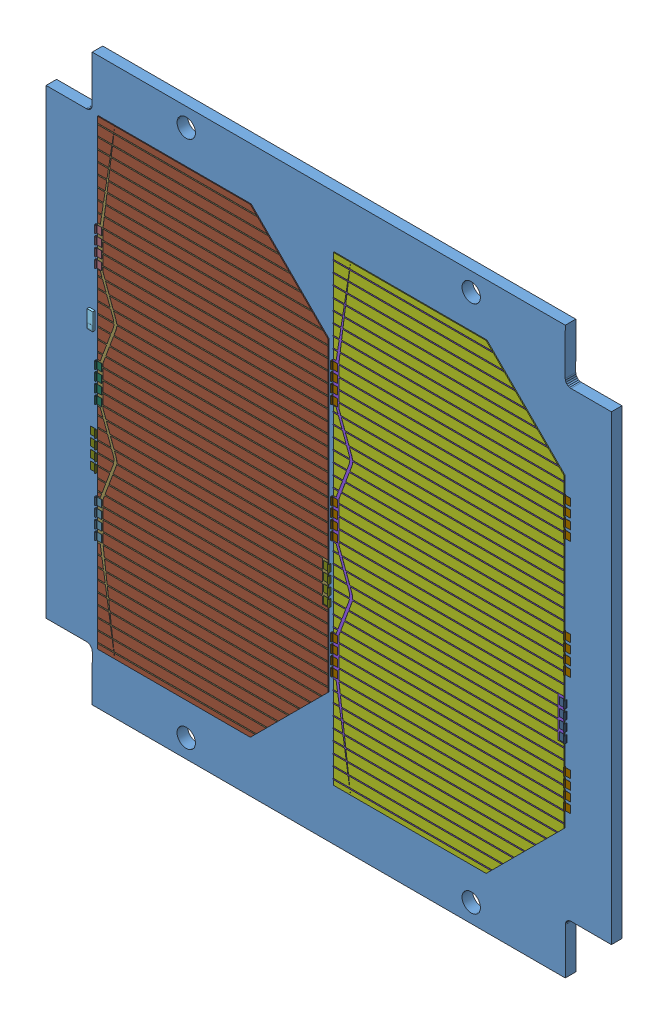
SolidWorks assembly P110UC.SLDASM, configuration Default (file format 7000). Lengths in mm.
Overall size (98 98 7.77).
46 component instances, 19 part files, 0 mates.
Components (placement in the parent):
- Board_2-1: Board_2.sldprt [Default] at (0 0 -1.8134) size (98 98 1.83)
- U2_2-1: U2_2.sldasm [Default] at origin size (11 11 5.5)
  - adis16251_2-1: adis16251_2.sldprt [Default] at (-2.5187 25.9949 -1.8134) x (-1 0 0) z (0 0 -1) size (11 11 5.5)
- Imported_2-1: Imported_2.sldasm [Default] at origin size (4.2 10.15 4.7)
  - 533980471_2-1: 533980471_2.sldasm [Default] at (10.95 68.2 -4.1634) x (0 -1 0) z (0 0 -1) size (10.15 4.2 4.7)
    - Open CASCADE STEP translator 6.2 8.3.1.1-1: Open CASCADE STEP translator 6.2 8.3.1.1.sldprt [Default] at origin size (10.15 4.2 4.7)
- H2_2-1: H2_2.sldasm [Default] at origin size (4.2 20.15 4.7)
  - 533981271_2-1: 533981271_2.sldasm [Default] at (10.85 51.925 -4.1634) x (0 -1 0) z (0 0 -1) size (20.15 4.2 4.7)
    - Open CASCADE STEP translator 6.2 8.4.1.1-1: Open CASCADE STEP translator 6.2 8.4.1.1.sldprt [Default] at origin size (20.15 4.2 4.7)
- D1_2-1: D1_2.sldasm [Default] at origin size (1 3 0.41)
  - sunsensor_2-1: sunsensor_2.sldprt [Default] at (8.3425 41.2449 0.0127) x (0 -1 0) z (0 0 1) size (3 1 0.41)
- D3_2-1: D3_2.sldasm [Default] at origin size (5.1 6.9 0.7)
  - 421952288_2-1: 421952288_2.sldasm [Default] at (23.3 69.4 -2.5134) size (5.1 6.9 0.7)
    - Extruded_5-1: Extruded_5.sldprt [Default] at origin size (5.1 6.9 0.7)
- PV4_2-1: PV4_2.sldasm [Default] at origin size (47.92 80 0.47)
  - 3G30C-anode_2-1: 3G30C-anode_2.sldasm [Default] at (73.747 69 0.0227) x (0 -1 0) z (0 0 1) size (80 47.92 0.47)
    - 3G28-base_3-1: 3G28-base_3.sldprt [Default] at origin size (80 40 0.15)
    - 3G30C_3-1: 3G30C_3.sldprt [Default] at (-2.952 -0.0367 0.15) size (80 40 0.01)
    - covar-tab_5-1: covar-tab_5.sldprt [Default] at (2.825 -23.042 0.16) x (0 -1 0) z (-1 0 0) size (7.53 0.46 6.5)
    - covar-tab_5-2: covar-tab_5.sldprt [Default] at (43.675 -23.042 0.16) x (0 -1 0) z (-1 0 0) size (7.53 0.46 6.5)
    - covar-tab_5-3: covar-tab_5.sldprt [Default] at (23.25 -23.042 0.16) x (0 -1 0) z (-1 0 0) size (7.53 0.46 6.5)
    - covar-tab_1_3-1: covar-tab_1_3.sldprt [Default] at (27.075 15.448 0.16) x (0 1 0) z (1 0 0) size (1.9 0.46 6.5)
    - covar-tab_5-4: covar-tab_5.sldprt [Default] at (2.825 17.348 0.175) x (0 -1 0) z (-1 0 0) size (7.53 0.46 6.5)
    - covar-tab_5-5: covar-tab_5.sldprt [Default] at (23.25 17.348 0.175) x (0 -1 0) z (-1 0 0) size (7.53 0.46 6.5)
    - covar-tab_5-6: covar-tab_5.sldprt [Default] at (43.675 17.348 0.175) x (0 -1 0) z (-1 0 0) size (7.53 0.46 6.5)
- PV5_2-1: PV5_2.sldasm [Default] at origin size (47.92 80 0.47)
  - 3G30C-cathode_2-1: 3G30C-cathode_2.sldasm [Default] at (32.867 69 0.0227) x (0 -1 0) z (0 0 1) size (80 47.92 0.47)
    - 3G28-base_3_2-1: 3G28-base_3_2.sldprt [Default] at origin size (80 40 0.15)
    - 3G30C_3_2-1: 3G30C_3_2.sldprt [Default] at (-2.952 -0.0367 0.15) size (80 40 0.01)
    - covar-tab_5_2-1: covar-tab_5_2.sldprt [Default] at (2.825 -23.042 0.16) x (0 -1 0) z (-1 0 0) size (1.9 0.46 6.5)
    - covar-tab_1_3_2-1: covar-tab_1_3_2.sldprt [Default] at (43.675 -23.042 0.16) x (0 -1 0) z (-1 0 0) size (1.9 0.46 6.5)
    - covar-tab_2_2-1: covar-tab_2_2.sldprt [Default] at (23.25 -23.042 0.16) x (0 -1 0) z (-1 0 0) size (1.9 0.46 6.5)
    - covar-tab_5_3-1: covar-tab_5_3.sldprt [Default] at (27.075 15.448 0.16) x (0 1 0) z (1 0 0) size (7.53 0.46 6.5)
    - covar-tab_5_3-2: covar-tab_5_3.sldprt [Default] at (27.075 -24.942 0.175) x (0 1 0) z (1 0 0) size (7.53 0.46 6.5)
- U1_2-1: U1_2.sldasm [Default] at origin size (3.2 3.2 1.09)
  - 421952416_2-1: 421952416_2.sldasm [Default] at (16.5 55.8 -2.9034) size (3.2 3.2 1.09)
    - Extruded_5_2-1: Extruded_5_2.sldprt [Default] at origin size (3.2 3.2 1.09)
- C1_2-1: C1_2.sldasm [Default] at origin size (1.75 0.95 0.85)
  - 421952672_2-1: 421952672_2.sldasm [Default] at (14.3 41.05 -2.6634) size (1.75 0.95 0.85)
    - Extruded_5_3-1: Extruded_5_3.sldprt [Default] at origin size (1.75 0.95 0.85)
- C2_2-1: C2_2.sldasm [Default] at origin size (0.95 1.75 0.85)
  - 421952544_2-1: 421952544_2.sldasm [Default] at (14.4 55.05 -2.6634) size (0.95 1.75 0.85)
    - Extruded_5_4-1: Extruded_5_4.sldprt [Default] at origin size (0.95 1.75 0.85)
- S2_2-1: S2_2.sldasm [Default] at origin size (4.2 10.15 4.7)
  - 533980471_2-1: 533980471_2.sldasm [Default] at (16.2 68.2 -4.1634) x (0 -1 0) z (0 0 -1) size (10.15 4.2 4.7)
    - Open CASCADE STEP translator 6.2 8.3.1.1-1: Open CASCADE STEP translator 6.2 8.3.1.1.sldprt [Default] at origin size (10.15 4.2 4.7)
